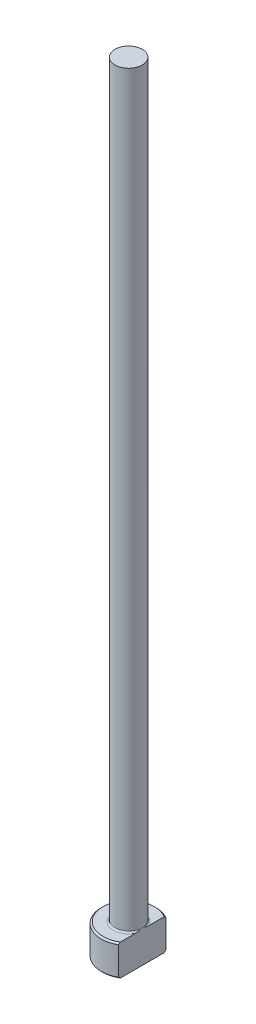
from build123d import *
from build123d.topology import SkipClean

# Parameters (mm, degrees)
CHAMFER1_SIZE    = 0.2
FILLET1_R        = 0.2
KEYED_HEAD_DEPTH = 101.122425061


with BuildPart() as part:
    # Sketch1 → Revolve1 (revolve)
    with BuildSketch(Plane.XY, mode=Mode.PRIVATE) as revolve1_sk:
        Polygon((0, 0), (-3.5, 0), (-3.5, 4), (-1.75, 4), (-1.75, 100), (0, 100), align=None)
    revolve(revolve1_sk.sketch.rotate(Axis((0, 259.958771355, 0), (0, -1, 0)), 270), axis=Axis((0, 259.958771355, 0), (0, -1, 0)))

    # Chamfer1
    chamfer1_edges = [part.edges().sort_by_distance(p)[0] for p in [
        (0, 4, -3.5),
        (0, 0, -3.5),
    ]]
    chamfer(chamfer1_edges, length=CHAMFER1_SIZE)

    # Fillet1
    fillet1_edges = [part.edges().sort_by_distance(p)[0] for p in [
        (0, 4, -1.75),
    ]]
    fillet(fillet1_edges, radius=FILLET1_R)

    # Sketch2 → KEYED HEAD (cut, through all)
    with SkipClean():  # the faces are left unmerged after this step: merging them gives an invalid solid
        with BuildSketch(Plane(origin=(0, 0, 0), x_dir=(1, 0, 0), z_dir=(0, 1, 0))):
            with BuildLine():
                Line((1.75, -3.031088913), (1.75, 3.031088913))
                ThreePointArc((1.75, 3.031088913), (3.5, 0), (1.75, -3.031088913))
            make_face()
        extrude(amount=KEYED_HEAD_DEPTH, mode=Mode.SUBTRACT)


solid = part.part
